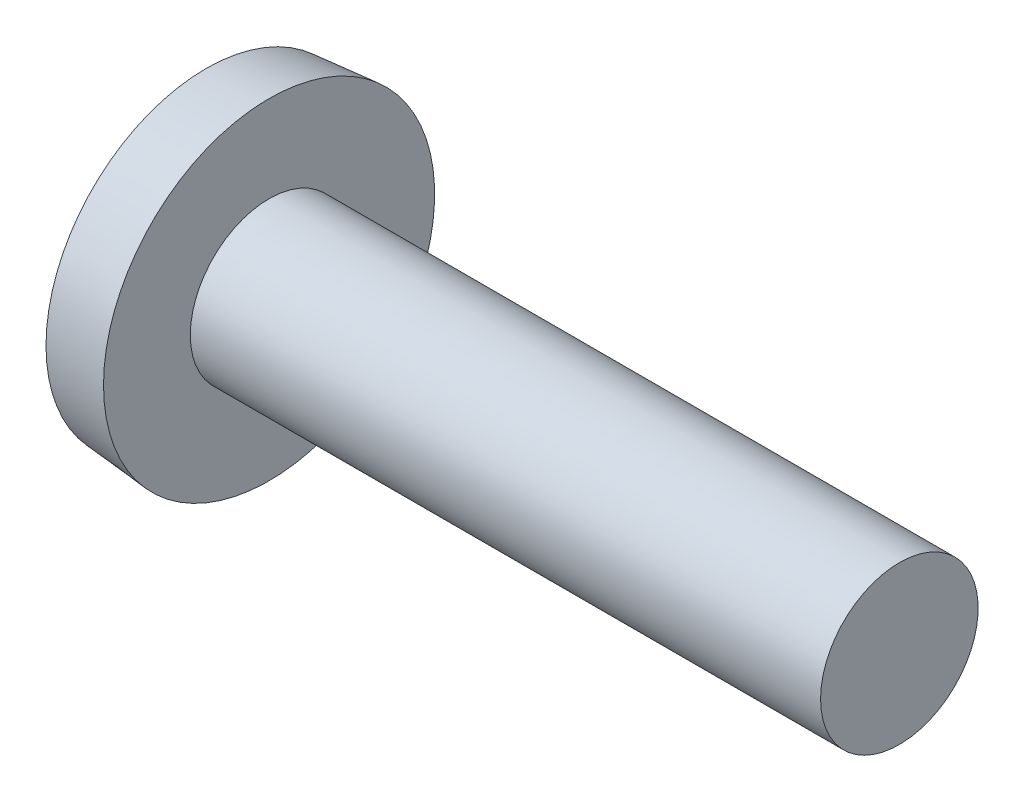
ISO-10303-21;
HEADER;
FILE_DESCRIPTION(('STEP AP214'),'2;1');
FILE_NAME('part.step','',(''),(''),'','','');
FILE_SCHEMA(('AUTOMOTIVE_DESIGN { 1 0 10303 214 1 1 1 1 }'));
ENDSEC;
DATA;
#1=APPLICATION_CONTEXT('core data for automotive mechanical design processes');
#2=APPLICATION_PROTOCOL_DEFINITION('international standard','automotive_design',2000,#1);
#3=PRODUCT_CONTEXT('',#1,'mechanical');
#4=PRODUCT('Part','Part','',(#3));
#5=PRODUCT_RELATED_PRODUCT_CATEGORY('part','',(#4));
#6=PRODUCT_DEFINITION_FORMATION('','',#4);
#7=PRODUCT_DEFINITION_CONTEXT('part definition',#1,'design');
#8=PRODUCT_DEFINITION('design','',#6,#7);
#9=PRODUCT_DEFINITION_SHAPE('','',#8);
#10=(LENGTH_UNIT() NAMED_UNIT(*) SI_UNIT(.MILLI.,.METRE.));
#11=(NAMED_UNIT(*) PLANE_ANGLE_UNIT() SI_UNIT($,.RADIAN.));
#12=(NAMED_UNIT(*) SI_UNIT($,.STERADIAN.) SOLID_ANGLE_UNIT());
#13=UNCERTAINTY_MEASURE_WITH_UNIT(LENGTH_MEASURE(1.E-05),#10,'distance_accuracy_value','');
#14=(GEOMETRIC_REPRESENTATION_CONTEXT(3) GLOBAL_UNCERTAINTY_ASSIGNED_CONTEXT((#13)) GLOBAL_UNIT_ASSIGNED_CONTEXT((#10,
#11,#12)) REPRESENTATION_CONTEXT('',''));
#15=CARTESIAN_POINT('',(0.,0.,0.));
#16=DIRECTION('',(0.,0.,1.));
#17=DIRECTION('',(1.,0.,0.));
#18=AXIS2_PLACEMENT_3D('',#15,#16,#17);
#19=CARTESIAN_POINT('',(20.7932858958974,0.,0.));
#20=DIRECTION('',(-1.,0.,0.));
#21=DIRECTION('',(0.,1.,0.));
#22=AXIS2_PLACEMENT_3D('',#19,#20,#21);
#23=SPHERICAL_SURFACE('',#22,20.7932858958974);
#24=CARTESIAN_POINT('',(10.7968001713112,0.,-7.77883530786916));
#25=DIRECTION('',(0.789207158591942,0.,0.61412707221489));
#26=DIRECTION('',(0.61412707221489,0.,-0.789207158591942));
#27=AXIS2_PLACEMENT_3D('',#24,#25,#26);
#28=CIRCLE('',#27,16.4900191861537);
#29=CARTESIAN_POINT('',(0.683324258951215,0.850899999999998,5.21786838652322));
#30=VERTEX_POINT('',#29);
#31=CARTESIAN_POINT('',(0.686560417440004,0.94739679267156,5.21370963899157));
#32=VERTEX_POINT('',#31);
#33=EDGE_CURVE('E386',#30,#32,#28,.F.);
#34=ORIENTED_EDGE('',*,*,#33,.F.);
#35=CARTESIAN_POINT('',(20.7932858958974,0.850899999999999,0.));
#36=DIRECTION('',(0.,-1.,0.));
#37=DIRECTION('',(0.,0.,-1.));
#38=AXIS2_PLACEMENT_3D('',#35,#36,#37);
#39=CIRCLE('',#38,20.7758683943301);
#40=CARTESIAN_POINT('',(2.2606,0.850899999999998,9.39022156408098));
#41=VERTEX_POINT('',#40);
#42=EDGE_CURVE('E278',#30,#41,#39,.F.);
#43=ORIENTED_EDGE('',*,*,#42,.T.);
#44=CARTESIAN_POINT('',(2.2606,0.,0.));
#45=DIRECTION('',(-1.,0.,0.));
#46=DIRECTION('',(0.,0.,1.));
#47=AXIS2_PLACEMENT_3D('',#44,#45,#46);
#48=CIRCLE('',#47,9.42869512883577);
#49=CARTESIAN_POINT('',(2.2606,-0.8509,9.39022156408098));
#50=VERTEX_POINT('',#49);
#51=EDGE_CURVE('E280',#41,#50,#48,.F.);
#52=ORIENTED_EDGE('',*,*,#51,.T.);
#53=CARTESIAN_POINT('',(20.7932858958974,-0.8509,0.));
#54=DIRECTION('',(0.,1.,0.));
#55=DIRECTION('',(0.,0.,1.));
#56=AXIS2_PLACEMENT_3D('',#53,#54,#55);
#57=CIRCLE('',#56,20.7758683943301);
#58=CARTESIAN_POINT('',(0.683324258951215,-0.8509,5.21786838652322));
#59=VERTEX_POINT('',#58);
#60=EDGE_CURVE('E286',#50,#59,#57,.F.);
#61=ORIENTED_EDGE('',*,*,#60,.T.);
#62=CARTESIAN_POINT('',(0.68656041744,-0.947396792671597,5.21370963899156));
#63=VERTEX_POINT('',#62);
#64=EDGE_CURVE('E387',#63,#59,#28,.F.);
#65=ORIENTED_EDGE('',*,*,#64,.F.);
#66=CARTESIAN_POINT('',(20.6258579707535,1.41383581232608,0.));
#67=DIRECTION('',(-0.117599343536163,0.993061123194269,0.));
#68=DIRECTION('',(-0.993061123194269,-0.117599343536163,0.));
#69=AXIS2_PLACEMENT_3D('',#66,#67,#68);
#70=CIRCLE('',#69,20.7444878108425);
#71=CARTESIAN_POINT('',(0.0503651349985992,-1.02273570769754,1.02273570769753));
#72=VERTEX_POINT('',#71);
#73=EDGE_CURVE('E373',#63,#72,#70,.F.);
#74=ORIENTED_EDGE('',*,*,#73,.T.);
#75=CARTESIAN_POINT('',(20.6258579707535,0.,-1.41383581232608));
#76=DIRECTION('',(-0.117599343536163,0.,-0.993061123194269));
#77=DIRECTION('',(-0.993061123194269,0.,0.117599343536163));
#78=AXIS2_PLACEMENT_3D('',#75,#76,#77);
#79=CIRCLE('',#78,20.7444878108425);
#80=CARTESIAN_POINT('',(0.686560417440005,-5.21370963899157,0.947396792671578));
#81=VERTEX_POINT('',#80);
#82=EDGE_CURVE('E247',#72,#81,#79,.F.);
#83=ORIENTED_EDGE('',*,*,#82,.T.);
#84=CARTESIAN_POINT('',(10.7968001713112,7.77883530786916,0.));
#85=DIRECTION('',(0.789207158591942,-0.61412707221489,0.));
#86=DIRECTION('',(0.61412707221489,0.789207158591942,0.));
#87=AXIS2_PLACEMENT_3D('',#84,#85,#86);
#88=CIRCLE('',#87,16.4900191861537);
#89=CARTESIAN_POINT('',(0.686560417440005,-5.21370963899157,-0.947396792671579));
#90=VERTEX_POINT('',#89);
#91=EDGE_CURVE('E298',#90,#81,#88,.F.);
#92=ORIENTED_EDGE('',*,*,#91,.F.);
#93=CARTESIAN_POINT('',(20.6258579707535,0.,1.41383581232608));
#94=DIRECTION('',(-0.117599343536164,0.,0.993061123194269));
#95=DIRECTION('',(0.993061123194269,0.,0.117599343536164));
#96=AXIS2_PLACEMENT_3D('',#93,#94,#95);
#97=CIRCLE('',#96,20.7444878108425);
#98=CARTESIAN_POINT('',(0.0503651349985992,-1.02273570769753,-1.02273570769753));
#99=VERTEX_POINT('',#98);
#100=EDGE_CURVE('E259',#90,#99,#97,.F.);
#101=ORIENTED_EDGE('',*,*,#100,.T.);
#102=CARTESIAN_POINT('',(0.686560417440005,-0.94739679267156,-5.21370963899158));
#103=VERTEX_POINT('',#102);
#104=EDGE_CURVE('E52',#99,#103,#70,.F.);
#105=ORIENTED_EDGE('',*,*,#104,.T.);
#106=CARTESIAN_POINT('',(10.7968001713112,0.,7.77883530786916));
#107=DIRECTION('',(0.789207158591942,0.,-0.61412707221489));
#108=DIRECTION('',(-0.61412707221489,0.,-0.789207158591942));
#109=AXIS2_PLACEMENT_3D('',#106,#107,#108);
#110=CIRCLE('',#109,16.4900191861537);
#111=CARTESIAN_POINT('',(0.683324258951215,-0.8509,-5.21786838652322));
#112=VERTEX_POINT('',#111);
#113=EDGE_CURVE('E361',#112,#103,#110,.F.);
#114=ORIENTED_EDGE('',*,*,#113,.F.);
#115=CARTESIAN_POINT('',(2.2606,-0.8509,-9.39022156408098));
#116=VERTEX_POINT('',#115);
#117=EDGE_CURVE('E284',#112,#116,#57,.F.);
#118=ORIENTED_EDGE('',*,*,#117,.T.);
#119=CARTESIAN_POINT('',(2.2606,0.8509,-9.39022156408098));
#120=VERTEX_POINT('',#119);
#121=EDGE_CURVE('E283',#116,#120,#48,.F.);
#122=ORIENTED_EDGE('',*,*,#121,.T.);
#123=CARTESIAN_POINT('',(0.683324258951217,0.850899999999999,-5.21786838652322));
#124=VERTEX_POINT('',#123);
#125=EDGE_CURVE('E285',#120,#124,#39,.F.);
#126=ORIENTED_EDGE('',*,*,#125,.T.);
#127=CARTESIAN_POINT('',(0.686560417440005,0.947396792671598,-5.21370963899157));
#128=VERTEX_POINT('',#127);
#129=EDGE_CURVE('E367',#128,#124,#110,.F.);
#130=ORIENTED_EDGE('',*,*,#129,.F.);
#131=CARTESIAN_POINT('',(20.6258579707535,-1.41383581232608,0.));
#132=DIRECTION('',(-0.117599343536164,-0.993061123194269,0.));
#133=DIRECTION('',(0.993061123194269,-0.117599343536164,0.));
#134=AXIS2_PLACEMENT_3D('',#131,#132,#133);
#135=CIRCLE('',#134,20.7444878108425);
#136=CARTESIAN_POINT('',(0.0503651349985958,1.02273570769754,-1.02273570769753));
#137=VERTEX_POINT('',#136);
#138=EDGE_CURVE('E234',#128,#137,#135,.F.);
#139=ORIENTED_EDGE('',*,*,#138,.T.);
#140=CARTESIAN_POINT('',(0.68656041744,5.21370963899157,-0.947396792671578));
#141=VERTEX_POINT('',#140);
#142=EDGE_CURVE('E251',#137,#141,#97,.F.);
#143=ORIENTED_EDGE('',*,*,#142,.T.);
#144=CARTESIAN_POINT('',(10.7968001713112,-7.77883530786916,0.));
#145=DIRECTION('',(0.789207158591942,0.61412707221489,0.));
#146=DIRECTION('',(-0.61412707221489,0.789207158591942,0.));
#147=AXIS2_PLACEMENT_3D('',#144,#145,#146);
#148=CIRCLE('',#147,16.4900191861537);
#149=CARTESIAN_POINT('',(0.686560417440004,5.21370963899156,0.947396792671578));
#150=VERTEX_POINT('',#149);
#151=EDGE_CURVE('E296',#150,#141,#148,.F.);
#152=ORIENTED_EDGE('',*,*,#151,.F.);
#153=CARTESIAN_POINT('',(0.0503651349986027,1.02273570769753,1.02273570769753));
#154=VERTEX_POINT('',#153);
#155=EDGE_CURVE('E211',#150,#154,#79,.F.);
#156=ORIENTED_EDGE('',*,*,#155,.T.);
#157=EDGE_CURVE('E238',#154,#32,#135,.F.);
#158=ORIENTED_EDGE('',*,*,#157,.T.);
#159=EDGE_LOOP('',(#34,#43,#52,#61,#65,#74,#83,#92,#101,#105,#114,#118,#122,#126,#130,#139,#143,
#152,#156,#158));
#160=FACE_BOUND('',#159,.T.);
#161=CARTESIAN_POINT('',(2.3876,0.,0.));
#162=DIRECTION('',(-1.,0.,0.));
#163=DIRECTION('',(0.,0.,1.));
#164=AXIS2_PLACEMENT_3D('',#161,#162,#163);
#165=CIRCLE('',#164,9.67426819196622);
#166=CARTESIAN_POINT('',(2.3876,0.,9.67426819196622));
#167=VERTEX_POINT('',#166);
#168=EDGE_CURVE('E272',#167,#167,#165,.T.);
#169=ORIENTED_EDGE('',*,*,#168,.T.);
#170=EDGE_LOOP('',(#169));
#171=FACE_BOUND('',#170,.T.);
#172=ADVANCED_FACE('F36',(#160,#171),#23,.T.);
#173=CARTESIAN_POINT('',(2.2606,-0.8509,10.0076));
#174=DIRECTION('',(0.,1.,0.));
#175=DIRECTION('',(0.,0.,1.));
#176=AXIS2_PLACEMENT_3D('',#173,#174,#175);
#177=PLANE('',#176);
#178=DIRECTION('',(-0.61412707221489,0.,-0.789207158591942));
#179=VECTOR('',#178,1.);
#180=CARTESIAN_POINT('',(8.65757782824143,-0.8509,5.02974694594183));
#181=LINE('',#180,#179);
#182=CARTESIAN_POINT('',(1.50142222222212,-0.850899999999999,-4.16654074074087));
#183=VERTEX_POINT('',#182);
#184=EDGE_CURVE('E370',#183,#112,#181,.T.);
#185=ORIENTED_EDGE('',*,*,#184,.F.);
#186=DIRECTION('',(0.,0.,1.));
#187=VECTOR('',#186,1.);
#188=CARTESIAN_POINT('',(1.50142222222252,-0.8509,10.0076));
#189=LINE('',#188,#187);
#190=CARTESIAN_POINT('',(1.50142222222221,-0.850899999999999,-0.850900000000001));
#191=VERTEX_POINT('',#190);
#192=EDGE_CURVE('E379',#183,#191,#189,.T.);
#193=ORIENTED_EDGE('',*,*,#192,.T.);
#194=DIRECTION('',(0.993061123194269,0.,0.117599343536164));
#195=VECTOR('',#194,1.);
#196=CARTESIAN_POINT('',(3.51819272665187,-0.8509,-0.61207191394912));
#197=LINE('',#196,#195);
#198=CARTESIAN_POINT('',(2.2606,-0.8509,-0.760997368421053));
#199=VERTEX_POINT('',#198);
#200=EDGE_CURVE('E255',#191,#199,#197,.T.);
#201=ORIENTED_EDGE('',*,*,#200,.T.);
#202=DIRECTION('',(0.,0.,-1.));
#203=VECTOR('',#202,1.);
#204=CARTESIAN_POINT('',(2.2606,-0.8509,10.0076));
#205=LINE('',#204,#203);
#206=EDGE_CURVE('E262',#199,#116,#205,.T.);
#207=ORIENTED_EDGE('',*,*,#206,.T.);
#208=ORIENTED_EDGE('',*,*,#117,.F.);
#209=EDGE_LOOP('',(#185,#193,#201,#207,#208));
#210=FACE_BOUND('',#209,.T.);
#211=ADVANCED_FACE('F438',(#210),#177,.T.);
#212=CARTESIAN_POINT('',(2.2606,0.8509,-10.0076));
#213=DIRECTION('',(0.,-1.,0.));
#214=DIRECTION('',(0.,0.,-1.));
#215=AXIS2_PLACEMENT_3D('',#212,#213,#214);
#216=PLANE('',#215);
#217=DIRECTION('',(-0.993061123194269,0.,-0.117599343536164));
#218=VECTOR('',#217,1.);
#219=CARTESIAN_POINT('',(1.18075089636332,0.850899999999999,-0.888874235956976));
#220=LINE('',#219,#218);
#221=CARTESIAN_POINT('',(2.2606,0.8509,-0.760997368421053));
#222=VERTEX_POINT('',#221);
#223=CARTESIAN_POINT('',(1.50142222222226,0.850899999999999,-0.850899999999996));
#224=VERTEX_POINT('',#223);
#225=EDGE_CURVE('E248',#222,#224,#220,.T.);
#226=ORIENTED_EDGE('',*,*,#225,.T.);
#227=DIRECTION('',(0.,0.,-1.));
#228=VECTOR('',#227,1.);
#229=CARTESIAN_POINT('',(1.50142222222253,0.8509,-10.0076));
#230=LINE('',#229,#228);
#231=CARTESIAN_POINT('',(1.50142222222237,0.850899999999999,-4.16654074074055));
#232=VERTEX_POINT('',#231);
#233=EDGE_CURVE('E64',#224,#232,#230,.T.);
#234=ORIENTED_EDGE('',*,*,#233,.T.);
#235=DIRECTION('',(0.61412707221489,0.,0.789207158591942));
#236=VECTOR('',#235,1.);
#237=CARTESIAN_POINT('',(-1.04325884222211,0.8509,-7.43667912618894));
#238=LINE('',#237,#236);
#239=EDGE_CURVE('E402',#124,#232,#238,.T.);
#240=ORIENTED_EDGE('',*,*,#239,.F.);
#241=ORIENTED_EDGE('',*,*,#125,.F.);
#242=DIRECTION('',(0.,0.,1.));
#243=VECTOR('',#242,1.);
#244=CARTESIAN_POINT('',(2.2606,0.8509,-10.0076));
#245=LINE('',#244,#243);
#246=EDGE_CURVE('E265',#120,#222,#245,.T.);
#247=ORIENTED_EDGE('',*,*,#246,.T.);
#248=EDGE_LOOP('',(#226,#234,#240,#241,#247));
#249=FACE_BOUND('',#248,.T.);
#250=ADVANCED_FACE('F397',(#249),#216,.T.);
#251=CARTESIAN_POINT('',(2.2606,-0.8509,10.0076));
#252=DIRECTION('',(-1.,0.,0.));
#253=DIRECTION('',(0.,0.,1.));
#254=AXIS2_PLACEMENT_3D('',#251,#252,#253);
#255=PLANE('',#254);
#256=DIRECTION('',(0.,-1.,0.));
#257=VECTOR('',#256,1.);
#258=CARTESIAN_POINT('',(2.2606,-0.850899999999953,-3.19093070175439));
#259=LINE('',#258,#257);
#260=CARTESIAN_POINT('',(2.2606,0.760997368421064,-3.19093070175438));
#261=VERTEX_POINT('',#260);
#262=CARTESIAN_POINT('',(2.2606,-0.760997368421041,-3.19093070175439));
#263=VERTEX_POINT('',#262);
#264=EDGE_CURVE('E331',#261,#263,#259,.T.);
#265=ORIENTED_EDGE('',*,*,#264,.F.);
#266=DIRECTION('',(0.,0.,1.));
#267=VECTOR('',#266,1.);
#268=CARTESIAN_POINT('',(2.2606,0.760997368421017,10.0076));
#269=LINE('',#268,#267);
#270=CARTESIAN_POINT('',(2.2606,0.760997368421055,-0.760997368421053));
#271=VERTEX_POINT('',#270);
#272=EDGE_CURVE('E393',#261,#271,#269,.T.);
#273=ORIENTED_EDGE('',*,*,#272,.T.);
#274=DIRECTION('',(0.,1.,0.));
#275=VECTOR('',#274,1.);
#276=CARTESIAN_POINT('',(2.2606,-0.850899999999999,-0.760997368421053));
#277=LINE('',#276,#275);
#278=EDGE_CURVE('E293',#271,#222,#277,.T.);
#279=ORIENTED_EDGE('',*,*,#278,.T.);
#280=ORIENTED_EDGE('',*,*,#246,.F.);
#281=ORIENTED_EDGE('',*,*,#121,.F.);
#282=ORIENTED_EDGE('',*,*,#206,.F.);
#283=CARTESIAN_POINT('',(2.2606,-0.76099736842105,-0.760997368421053));
#284=VERTEX_POINT('',#283);
#285=EDGE_CURVE('E291',#199,#284,#277,.T.);
#286=ORIENTED_EDGE('',*,*,#285,.T.);
#287=DIRECTION('',(0.,0.,-1.));
#288=VECTOR('',#287,1.);
#289=CARTESIAN_POINT('',(2.2606,-0.760997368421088,10.0076));
#290=LINE('',#289,#288);
#291=EDGE_CURVE('E338',#284,#263,#290,.T.);
#292=ORIENTED_EDGE('',*,*,#291,.T.);
#293=EDGE_LOOP('',(#265,#273,#279,#280,#281,#282,#286,#292));
#294=FACE_BOUND('',#293,.T.);
#295=ADVANCED_FACE('F401',(#294),#255,.T.);
#296=DIRECTION('',(0.,-1.,0.));
#297=VECTOR('',#296,1.);
#298=CARTESIAN_POINT('',(2.2606,-0.8509,0.760997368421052));
#299=LINE('',#298,#297);
#300=CARTESIAN_POINT('',(2.2606,0.8509,0.760997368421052));
#301=VERTEX_POINT('',#300);
#302=CARTESIAN_POINT('',(2.2606,0.76099736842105,0.760997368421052));
#303=VERTEX_POINT('',#302);
#304=EDGE_CURVE('E288',#301,#303,#299,.T.);
#305=ORIENTED_EDGE('',*,*,#304,.T.);
#306=DIRECTION('',(0.,0.,1.));
#307=VECTOR('',#306,1.);
#308=CARTESIAN_POINT('',(2.2606,0.760997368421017,10.0076));
#309=LINE('',#308,#307);
#310=CARTESIAN_POINT('',(2.2606,0.760997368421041,3.19093070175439));
#311=VERTEX_POINT('',#310);
#312=EDGE_CURVE('E191',#303,#311,#309,.T.);
#313=ORIENTED_EDGE('',*,*,#312,.T.);
#314=DIRECTION('',(0.,1.,0.));
#315=VECTOR('',#314,1.);
#316=CARTESIAN_POINT('',(2.2606,-0.850899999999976,3.19093070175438));
#317=LINE('',#316,#315);
#318=CARTESIAN_POINT('',(2.2606,-0.760997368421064,3.19093070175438));
#319=VERTEX_POINT('',#318);
#320=EDGE_CURVE('E203',#319,#311,#317,.T.);
#321=ORIENTED_EDGE('',*,*,#320,.F.);
#322=DIRECTION('',(0.,0.,-1.));
#323=VECTOR('',#322,1.);
#324=CARTESIAN_POINT('',(2.2606,-0.760997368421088,10.0076));
#325=LINE('',#324,#323);
#326=CARTESIAN_POINT('',(2.2606,-0.760997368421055,0.760997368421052));
#327=VERTEX_POINT('',#326);
#328=EDGE_CURVE('E365',#319,#327,#325,.T.);
#329=ORIENTED_EDGE('',*,*,#328,.T.);
#330=CARTESIAN_POINT('',(2.2606,-0.8509,0.760997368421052));
#331=VERTEX_POINT('',#330);
#332=EDGE_CURVE('E292',#327,#331,#299,.T.);
#333=ORIENTED_EDGE('',*,*,#332,.T.);
#334=EDGE_CURVE('E256',#50,#331,#205,.T.);
#335=ORIENTED_EDGE('',*,*,#334,.F.);
#336=ORIENTED_EDGE('',*,*,#51,.F.);
#337=EDGE_CURVE('E257',#301,#41,#245,.T.);
#338=ORIENTED_EDGE('',*,*,#337,.F.);
#339=EDGE_LOOP('',(#305,#313,#321,#329,#333,#335,#336,#338));
#340=FACE_BOUND('',#339,.T.);
#341=ADVANCED_FACE('F413',(#340),#255,.T.);
#342=CARTESIAN_POINT('',(4.74364505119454,0.,-0.466952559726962));
#343=DIRECTION('',(-0.117599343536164,0.,0.993061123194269));
#344=DIRECTION('',(0.993061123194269,0.,0.117599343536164));
#345=AXIS2_PLACEMENT_3D('',#342,#343,#344);
#346=PLANE('',#345);
#347=ORIENTED_EDGE('',*,*,#142,.F.);
#348=DIRECTION('',(0.986264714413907,-0.116794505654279,0.116794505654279));
#349=VECTOR('',#348,1.);
#350=CARTESIAN_POINT('',(4.79743345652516,0.460582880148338,-0.460582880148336));
#351=LINE('',#350,#349);
#352=EDGE_CURVE('E311',#137,#224,#351,.T.);
#353=ORIENTED_EDGE('',*,*,#352,.T.);
#354=ORIENTED_EDGE('',*,*,#225,.F.);
#355=ORIENTED_EDGE('',*,*,#278,.F.);
#356=CARTESIAN_POINT('',(4.3434,0.514350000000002,-0.514349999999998));
#357=VERTEX_POINT('',#356);
#358=EDGE_CURVE('E313',#271,#357,#351,.T.);
#359=ORIENTED_EDGE('',*,*,#358,.T.);
#360=DIRECTION('',(0.612509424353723,-0.787128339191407,0.0725340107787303));
#361=VECTOR('',#360,1.);
#362=CARTESIAN_POINT('',(0.,6.096,-1.0287));
#363=LINE('',#362,#361);
#364=EDGE_CURVE('E216',#141,#357,#363,.T.);
#365=ORIENTED_EDGE('',*,*,#364,.F.);
#366=EDGE_LOOP('',(#347,#353,#354,#355,#359,#365));
#367=FACE_BOUND('',#366,.T.);
#368=ADVANCED_FACE('F307',(#367),#346,.T.);
#369=DIRECTION('',(0.612509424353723,0.787128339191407,0.0725340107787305));
#370=VECTOR('',#369,1.);
#371=CARTESIAN_POINT('',(0.,-6.096,-1.0287));
#372=LINE('',#371,#370);
#373=CARTESIAN_POINT('',(4.3434,-0.51435,-0.51435));
#374=VERTEX_POINT('',#373);
#375=EDGE_CURVE('E217',#90,#374,#372,.T.);
#376=ORIENTED_EDGE('',*,*,#375,.T.);
#377=DIRECTION('',(-0.986264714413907,-0.116794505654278,-0.116794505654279));
#378=VECTOR('',#377,1.);
#379=CARTESIAN_POINT('',(4.79743345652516,-0.460582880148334,-0.460582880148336));
#380=LINE('',#379,#378);
#381=EDGE_CURVE('E336',#374,#284,#380,.T.);
#382=ORIENTED_EDGE('',*,*,#381,.T.);
#383=ORIENTED_EDGE('',*,*,#285,.F.);
#384=ORIENTED_EDGE('',*,*,#200,.F.);
#385=EDGE_CURVE('E341',#191,#99,#380,.T.);
#386=ORIENTED_EDGE('',*,*,#385,.T.);
#387=ORIENTED_EDGE('',*,*,#100,.F.);
#388=EDGE_LOOP('',(#376,#382,#383,#384,#386,#387));
#389=FACE_BOUND('',#388,.T.);
#390=ADVANCED_FACE('F348',(#389),#346,.T.);
#391=CARTESIAN_POINT('',(4.74364505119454,0.,0.466952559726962));
#392=DIRECTION('',(-0.117599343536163,0.,-0.993061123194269));
#393=DIRECTION('',(-0.993061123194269,0.,0.117599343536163));
#394=AXIS2_PLACEMENT_3D('',#391,#392,#393);
#395=PLANE('',#394);
#396=DIRECTION('',(0.612509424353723,-0.787128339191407,-0.0725340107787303));
#397=VECTOR('',#396,1.);
#398=CARTESIAN_POINT('',(0.,6.096,1.0287));
#399=LINE('',#398,#397);
#400=CARTESIAN_POINT('',(4.3434,0.514349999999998,0.514350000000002));
#401=VERTEX_POINT('',#400);
#402=EDGE_CURVE('E209',#150,#401,#399,.T.);
#403=ORIENTED_EDGE('',*,*,#402,.T.);
#404=DIRECTION('',(-0.986264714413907,0.116794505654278,0.116794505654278));
#405=VECTOR('',#404,1.);
#406=CARTESIAN_POINT('',(4.79743345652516,0.460582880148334,0.460582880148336));
#407=LINE('',#406,#405);
#408=EDGE_CURVE('E11',#401,#303,#407,.T.);
#409=ORIENTED_EDGE('',*,*,#408,.T.);
#410=ORIENTED_EDGE('',*,*,#304,.F.);
#411=DIRECTION('',(0.993061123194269,0.,-0.117599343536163));
#412=VECTOR('',#411,1.);
#413=CARTESIAN_POINT('',(3.51819272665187,0.850899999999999,0.612071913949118));
#414=LINE('',#413,#412);
#415=CARTESIAN_POINT('',(1.50142222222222,0.850899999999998,0.850899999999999));
#416=VERTEX_POINT('',#415);
#417=EDGE_CURVE('E245',#416,#301,#414,.T.);
#418=ORIENTED_EDGE('',*,*,#417,.F.);
#419=EDGE_CURVE('E45',#416,#154,#407,.T.);
#420=ORIENTED_EDGE('',*,*,#419,.T.);
#421=ORIENTED_EDGE('',*,*,#155,.F.);
#422=EDGE_LOOP('',(#403,#409,#410,#418,#420,#421));
#423=FACE_BOUND('',#422,.T.);
#424=ADVANCED_FACE('F212',(#423),#395,.T.);
#425=ORIENTED_EDGE('',*,*,#82,.F.);
#426=DIRECTION('',(0.986264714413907,0.116794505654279,-0.116794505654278));
#427=VECTOR('',#426,1.);
#428=CARTESIAN_POINT('',(4.79743345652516,-0.460582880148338,0.460582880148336));
#429=LINE('',#428,#427);
#430=CARTESIAN_POINT('',(1.5014222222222,-0.850900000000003,0.850900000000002));
#431=VERTEX_POINT('',#430);
#432=EDGE_CURVE('E362',#72,#431,#429,.T.);
#433=ORIENTED_EDGE('',*,*,#432,.T.);
#434=DIRECTION('',(-0.993061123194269,0.,0.117599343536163));
#435=VECTOR('',#434,1.);
#436=CARTESIAN_POINT('',(1.18075089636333,-0.8509,0.888874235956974));
#437=LINE('',#436,#435);
#438=EDGE_CURVE('E242',#331,#431,#437,.T.);
#439=ORIENTED_EDGE('',*,*,#438,.F.);
#440=ORIENTED_EDGE('',*,*,#332,.F.);
#441=CARTESIAN_POINT('',(4.3434,-0.51435,0.51435));
#442=VERTEX_POINT('',#441);
#443=EDGE_CURVE('E356',#327,#442,#429,.T.);
#444=ORIENTED_EDGE('',*,*,#443,.T.);
#445=DIRECTION('',(0.612509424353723,0.787128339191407,-0.0725340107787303));
#446=VECTOR('',#445,1.);
#447=CARTESIAN_POINT('',(0.,-6.096,1.0287));
#448=LINE('',#447,#446);
#449=EDGE_CURVE('E324',#81,#442,#448,.T.);
#450=ORIENTED_EDGE('',*,*,#449,.F.);
#451=EDGE_LOOP('',(#425,#433,#439,#440,#444,#450));
#452=FACE_BOUND('',#451,.T.);
#453=ADVANCED_FACE('F354',(#452),#395,.T.);
#454=DIRECTION('',(0.61412707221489,0.,-0.789207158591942));
#455=VECTOR('',#454,1.);
#456=CARTESIAN_POINT('',(-1.04325884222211,-0.8509,7.43667912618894));
#457=LINE('',#456,#455);
#458=CARTESIAN_POINT('',(1.50142222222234,-0.8509,4.16654074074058));
#459=VERTEX_POINT('',#458);
#460=EDGE_CURVE('E388',#59,#459,#457,.T.);
#461=ORIENTED_EDGE('',*,*,#460,.F.);
#462=ORIENTED_EDGE('',*,*,#60,.F.);
#463=ORIENTED_EDGE('',*,*,#334,.T.);
#464=ORIENTED_EDGE('',*,*,#438,.T.);
#465=DIRECTION('',(0.,0.,1.));
#466=VECTOR('',#465,1.);
#467=CARTESIAN_POINT('',(1.50142222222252,-0.8509,10.0076));
#468=LINE('',#467,#466);
#469=EDGE_CURVE('E371',#431,#459,#468,.T.);
#470=ORIENTED_EDGE('',*,*,#469,.T.);
#471=EDGE_LOOP('',(#461,#462,#463,#464,#470));
#472=FACE_BOUND('',#471,.T.);
#473=ADVANCED_FACE('F412',(#472),#177,.T.);
#474=DIRECTION('',(-0.61412707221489,0.,0.789207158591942));
#475=VECTOR('',#474,1.);
#476=CARTESIAN_POINT('',(8.65757782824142,0.850899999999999,-5.02974694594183));
#477=LINE('',#476,#475);
#478=CARTESIAN_POINT('',(1.50142222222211,0.850899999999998,4.16654074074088));
#479=VERTEX_POINT('',#478);
#480=EDGE_CURVE('E383',#479,#30,#477,.T.);
#481=ORIENTED_EDGE('',*,*,#480,.F.);
#482=DIRECTION('',(0.,0.,-1.));
#483=VECTOR('',#482,1.);
#484=CARTESIAN_POINT('',(1.50142222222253,0.8509,-10.0076));
#485=LINE('',#484,#483);
#486=EDGE_CURVE('E395',#479,#416,#485,.T.);
#487=ORIENTED_EDGE('',*,*,#486,.T.);
#488=ORIENTED_EDGE('',*,*,#417,.T.);
#489=ORIENTED_EDGE('',*,*,#337,.T.);
#490=ORIENTED_EDGE('',*,*,#42,.F.);
#491=EDGE_LOOP('',(#481,#487,#488,#489,#490));
#492=FACE_BOUND('',#491,.T.);
#493=ADVANCED_FACE('F423',(#492),#216,.T.);
#494=CARTESIAN_POINT('',(-25.4,0.,0.));
#495=DIRECTION('',(-1.,0.,0.));
#496=DIRECTION('',(0.,0.,1.));
#497=AXIS2_PLACEMENT_3D('',#494,#495,#496);
#498=CYLINDRICAL_SURFACE('',#497,4.7625);
#499=CARTESIAN_POINT('',(44.2976,0.,0.));
#500=DIRECTION('',(-1.,0.,0.));
#501=DIRECTION('',(0.,0.,1.));
#502=AXIS2_PLACEMENT_3D('',#499,#500,#501);
#503=CIRCLE('',#502,4.7625);
#504=CARTESIAN_POINT('',(44.2976,0.,4.7625));
#505=VERTEX_POINT('',#504);
#506=EDGE_CURVE('E274',#505,#505,#503,.T.);
#507=ORIENTED_EDGE('',*,*,#506,.T.);
#508=EDGE_LOOP('',(#507));
#509=FACE_BOUND('',#508,.T.);
#510=CARTESIAN_POINT('',(6.1976,0.,0.));
#511=DIRECTION('',(-1.,0.,0.));
#512=DIRECTION('',(0.,0.,1.));
#513=AXIS2_PLACEMENT_3D('',#510,#511,#512);
#514=CIRCLE('',#513,4.7625);
#515=CARTESIAN_POINT('',(6.1976,0.,4.7625));
#516=VERTEX_POINT('',#515);
#517=EDGE_CURVE('E263',#516,#516,#514,.T.);
#518=ORIENTED_EDGE('',*,*,#517,.F.);
#519=EDGE_LOOP('',(#518));
#520=FACE_BOUND('',#519,.T.);
#521=ADVANCED_FACE('F37',(#509,#520),#498,.T.);
#522=CARTESIAN_POINT('',(44.2976,4.7625,0.));
#523=DIRECTION('',(1.,0.,0.));
#524=DIRECTION('',(0.,0.,-1.));
#525=AXIS2_PLACEMENT_3D('',#522,#523,#524);
#526=PLANE('',#525);
#527=ORIENTED_EDGE('',*,*,#506,.F.);
#528=EDGE_LOOP('',(#527));
#529=FACE_BOUND('',#528,.T.);
#530=ADVANCED_FACE('F469',(#529),#526,.T.);
#531=CARTESIAN_POINT('',(6.1976,0.,0.));
#532=DIRECTION('',(1.,0.,0.));
#533=DIRECTION('',(0.,0.,-1.));
#534=AXIS2_PLACEMENT_3D('',#531,#532,#533);
#535=CONICAL_SURFACE('',#534,10.0076,0.0872664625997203);
#536=ORIENTED_EDGE('',*,*,#168,.F.);
#537=EDGE_LOOP('',(#536));
#538=FACE_BOUND('',#537,.T.);
#539=CARTESIAN_POINT('',(6.1976,0.,0.));
#540=DIRECTION('',(-1.,0.,0.));
#541=DIRECTION('',(0.,0.,1.));
#542=AXIS2_PLACEMENT_3D('',#539,#540,#541);
#543=CIRCLE('',#542,10.0076);
#544=CARTESIAN_POINT('',(6.1976,0.,10.0076));
#545=VERTEX_POINT('',#544);
#546=EDGE_CURVE('E270',#545,#545,#543,.T.);
#547=ORIENTED_EDGE('',*,*,#546,.T.);
#548=EDGE_LOOP('',(#547));
#549=FACE_BOUND('',#548,.T.);
#550=ADVANCED_FACE('F470',(#538,#549),#535,.T.);
#551=CARTESIAN_POINT('',(6.1976,4.7625,0.));
#552=DIRECTION('',(-1.,0.,0.));
#553=DIRECTION('',(0.,0.,1.));
#554=AXIS2_PLACEMENT_3D('',#551,#552,#553);
#555=PLANE('',#554);
#556=ORIENTED_EDGE('',*,*,#546,.F.);
#557=EDGE_LOOP('',(#556));
#558=FACE_BOUND('',#557,.T.);
#559=ORIENTED_EDGE('',*,*,#517,.T.);
#560=EDGE_LOOP('',(#559));
#561=FACE_BOUND('',#560,.T.);
#562=ADVANCED_FACE('F478',(#558,#561),#555,.F.);
#563=CARTESIAN_POINT('',(4.3434,0.51435,0.51435));
#564=DIRECTION('',(-1.,0.,0.));
#565=DIRECTION('',(0.,0.,1.));
#566=AXIS2_PLACEMENT_3D('',#563,#564,#565);
#567=PLANE('',#566);
#568=DIRECTION('',(0.,1.,0.));
#569=VECTOR('',#568,1.);
#570=CARTESIAN_POINT('',(4.3434,-0.51435,0.51435));
#571=LINE('',#570,#569);
#572=EDGE_CURVE('E204',#442,#401,#571,.T.);
#573=ORIENTED_EDGE('',*,*,#572,.T.);
#574=DIRECTION('',(0.,0.,-1.));
#575=VECTOR('',#574,1.);
#576=CARTESIAN_POINT('',(4.3434,0.51435,0.51435));
#577=LINE('',#576,#575);
#578=EDGE_CURVE('E222',#401,#357,#577,.T.);
#579=ORIENTED_EDGE('',*,*,#578,.T.);
#580=DIRECTION('',(0.,-1.,0.));
#581=VECTOR('',#580,1.);
#582=CARTESIAN_POINT('',(4.3434,0.51435,-0.51435));
#583=LINE('',#582,#581);
#584=EDGE_CURVE('E226',#357,#374,#583,.T.);
#585=ORIENTED_EDGE('',*,*,#584,.T.);
#586=DIRECTION('',(0.,0.,1.));
#587=VECTOR('',#586,1.);
#588=CARTESIAN_POINT('',(4.3434,-0.51435,-0.51435));
#589=LINE('',#588,#587);
#590=EDGE_CURVE('E231',#374,#442,#589,.T.);
#591=ORIENTED_EDGE('',*,*,#590,.T.);
#592=EDGE_LOOP('',(#573,#579,#585,#591));
#593=FACE_BOUND('',#592,.T.);
#594=ADVANCED_FACE('F233',(#593),#567,.T.);
#595=CARTESIAN_POINT('',(4.3434,0.51435,0.51435));
#596=DIRECTION('',(0.789207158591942,0.61412707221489,0.));
#597=DIRECTION('',(-0.61412707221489,0.789207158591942,0.));
#598=AXIS2_PLACEMENT_3D('',#595,#596,#597);
#599=PLANE('',#598);
#600=ORIENTED_EDGE('',*,*,#151,.T.);
#601=ORIENTED_EDGE('',*,*,#364,.T.);
#602=ORIENTED_EDGE('',*,*,#578,.F.);
#603=ORIENTED_EDGE('',*,*,#402,.F.);
#604=EDGE_LOOP('',(#600,#601,#602,#603));
#605=FACE_BOUND('',#604,.T.);
#606=ADVANCED_FACE('F223',(#605),#599,.F.);
#607=CARTESIAN_POINT('',(4.3434,-0.51435,-0.51435));
#608=DIRECTION('',(0.789207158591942,-0.61412707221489,0.));
#609=DIRECTION('',(0.61412707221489,0.789207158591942,0.));
#610=AXIS2_PLACEMENT_3D('',#607,#608,#609);
#611=PLANE('',#610);
#612=ORIENTED_EDGE('',*,*,#91,.T.);
#613=ORIENTED_EDGE('',*,*,#449,.T.);
#614=ORIENTED_EDGE('',*,*,#590,.F.);
#615=ORIENTED_EDGE('',*,*,#375,.F.);
#616=EDGE_LOOP('',(#612,#613,#614,#615));
#617=FACE_BOUND('',#616,.T.);
#618=ADVANCED_FACE('F349',(#617),#611,.F.);
#619=CARTESIAN_POINT('',(4.74364505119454,0.466952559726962,0.));
#620=DIRECTION('',(-0.117599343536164,-0.993061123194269,0.));
#621=DIRECTION('',(0.993061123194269,-0.117599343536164,0.));
#622=AXIS2_PLACEMENT_3D('',#619,#620,#621);
#623=PLANE('',#622);
#624=ORIENTED_EDGE('',*,*,#408,.F.);
#625=DIRECTION('',(0.612509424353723,-0.0725340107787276,-0.787128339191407));
#626=VECTOR('',#625,1.);
#627=CARTESIAN_POINT('',(0.,1.02869999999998,6.096));
#628=LINE('',#627,#626);
#629=EDGE_CURVE('E188',#311,#401,#628,.T.);
#630=ORIENTED_EDGE('',*,*,#629,.F.);
#631=ORIENTED_EDGE('',*,*,#312,.F.);
#632=EDGE_LOOP('',(#624,#630,#631));
#633=FACE_BOUND('',#632,.T.);
#634=ADVANCED_FACE('F186',(#633),#623,.T.);
#635=CARTESIAN_POINT('',(4.74364505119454,-0.466952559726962,0.));
#636=DIRECTION('',(-0.117599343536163,0.993061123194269,0.));
#637=DIRECTION('',(-0.993061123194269,-0.117599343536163,0.));
#638=AXIS2_PLACEMENT_3D('',#635,#636,#637);
#639=PLANE('',#638);
#640=DIRECTION('',(0.612509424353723,0.0725340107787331,-0.787128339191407));
#641=VECTOR('',#640,1.);
#642=CARTESIAN_POINT('',(0.,-1.02870000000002,6.096));
#643=LINE('',#642,#641);
#644=EDGE_CURVE('E429',#319,#442,#643,.T.);
#645=ORIENTED_EDGE('',*,*,#644,.T.);
#646=ORIENTED_EDGE('',*,*,#443,.F.);
#647=ORIENTED_EDGE('',*,*,#328,.F.);
#648=EDGE_LOOP('',(#645,#646,#647));
#649=FACE_BOUND('',#648,.T.);
#650=ADVANCED_FACE('F452',(#649),#639,.T.);
#651=CARTESIAN_POINT('',(4.3434,-0.514350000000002,0.514349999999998));
#652=DIRECTION('',(0.789207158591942,0.,0.61412707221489));
#653=DIRECTION('',(-0.61412707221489,0.,0.789207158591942));
#654=AXIS2_PLACEMENT_3D('',#651,#652,#653);
#655=PLANE('',#654);
#656=ORIENTED_EDGE('',*,*,#320,.T.);
#657=ORIENTED_EDGE('',*,*,#629,.T.);
#658=ORIENTED_EDGE('',*,*,#572,.F.);
#659=ORIENTED_EDGE('',*,*,#644,.F.);
#660=EDGE_LOOP('',(#656,#657,#658,#659));
#661=FACE_BOUND('',#660,.T.);
#662=ADVANCED_FACE('F199',(#661),#655,.F.);
#663=EDGE_CURVE('E207',#63,#459,#643,.T.);
#664=ORIENTED_EDGE('',*,*,#663,.T.);
#665=ORIENTED_EDGE('',*,*,#469,.F.);
#666=ORIENTED_EDGE('',*,*,#432,.F.);
#667=ORIENTED_EDGE('',*,*,#73,.F.);
#668=EDGE_LOOP('',(#664,#665,#666,#667));
#669=FACE_BOUND('',#668,.T.);
#670=ADVANCED_FACE('F442',(#669),#639,.T.);
#671=ORIENTED_EDGE('',*,*,#64,.T.);
#672=ORIENTED_EDGE('',*,*,#460,.T.);
#673=ORIENTED_EDGE('',*,*,#663,.F.);
#674=EDGE_LOOP('',(#671,#672,#673));
#675=FACE_BOUND('',#674,.T.);
#676=ADVANCED_FACE('F444',(#675),#655,.F.);
#677=ORIENTED_EDGE('',*,*,#419,.F.);
#678=ORIENTED_EDGE('',*,*,#486,.F.);
#679=EDGE_CURVE('E202',#32,#479,#628,.T.);
#680=ORIENTED_EDGE('',*,*,#679,.F.);
#681=ORIENTED_EDGE('',*,*,#157,.F.);
#682=EDGE_LOOP('',(#677,#678,#680,#681));
#683=FACE_BOUND('',#682,.T.);
#684=ADVANCED_FACE('F425',(#683),#623,.T.);
#685=ORIENTED_EDGE('',*,*,#33,.T.);
#686=ORIENTED_EDGE('',*,*,#679,.T.);
#687=ORIENTED_EDGE('',*,*,#480,.T.);
#688=EDGE_LOOP('',(#685,#686,#687));
#689=FACE_BOUND('',#688,.T.);
#690=ADVANCED_FACE('F428',(#689),#655,.F.);
#691=CARTESIAN_POINT('',(4.3434,0.514350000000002,-0.514349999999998));
#692=DIRECTION('',(0.789207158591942,0.,-0.61412707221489));
#693=DIRECTION('',(0.61412707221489,0.,0.789207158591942));
#694=AXIS2_PLACEMENT_3D('',#691,#692,#693);
#695=PLANE('',#694);
#696=ORIENTED_EDGE('',*,*,#264,.T.);
#697=DIRECTION('',(0.612509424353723,0.0725340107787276,0.787128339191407));
#698=VECTOR('',#697,1.);
#699=CARTESIAN_POINT('',(0.,-1.02869999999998,-6.096));
#700=LINE('',#699,#698);
#701=EDGE_CURVE('E328',#263,#374,#700,.T.);
#702=ORIENTED_EDGE('',*,*,#701,.T.);
#703=ORIENTED_EDGE('',*,*,#584,.F.);
#704=DIRECTION('',(0.612509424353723,-0.0725340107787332,0.787128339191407));
#705=VECTOR('',#704,1.);
#706=CARTESIAN_POINT('',(0.,1.02870000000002,-6.096));
#707=LINE('',#706,#705);
#708=EDGE_CURVE('E330',#261,#357,#707,.T.);
#709=ORIENTED_EDGE('',*,*,#708,.F.);
#710=EDGE_LOOP('',(#696,#702,#703,#709));
#711=FACE_BOUND('',#710,.T.);
#712=ADVANCED_FACE('F327',(#711),#695,.F.);
#713=ORIENTED_EDGE('',*,*,#381,.F.);
#714=ORIENTED_EDGE('',*,*,#701,.F.);
#715=ORIENTED_EDGE('',*,*,#291,.F.);
#716=EDGE_LOOP('',(#713,#714,#715));
#717=FACE_BOUND('',#716,.T.);
#718=ADVANCED_FACE('F339',(#717),#639,.T.);
#719=ORIENTED_EDGE('',*,*,#708,.T.);
#720=ORIENTED_EDGE('',*,*,#358,.F.);
#721=ORIENTED_EDGE('',*,*,#272,.F.);
#722=EDGE_LOOP('',(#719,#720,#721));
#723=FACE_BOUND('',#722,.T.);
#724=ADVANCED_FACE('F507',(#723),#623,.T.);
#725=ORIENTED_EDGE('',*,*,#385,.F.);
#726=ORIENTED_EDGE('',*,*,#192,.F.);
#727=EDGE_CURVE('E332',#103,#183,#700,.T.);
#728=ORIENTED_EDGE('',*,*,#727,.F.);
#729=ORIENTED_EDGE('',*,*,#104,.F.);
#730=EDGE_LOOP('',(#725,#726,#728,#729));
#731=FACE_BOUND('',#730,.T.);
#732=ADVANCED_FACE('F457',(#731),#639,.T.);
#733=ORIENTED_EDGE('',*,*,#113,.T.);
#734=ORIENTED_EDGE('',*,*,#727,.T.);
#735=ORIENTED_EDGE('',*,*,#184,.T.);
#736=EDGE_LOOP('',(#733,#734,#735));
#737=FACE_BOUND('',#736,.T.);
#738=ADVANCED_FACE('F436',(#737),#695,.F.);
#739=EDGE_CURVE('E431',#128,#232,#707,.T.);
#740=ORIENTED_EDGE('',*,*,#739,.T.);
#741=ORIENTED_EDGE('',*,*,#233,.F.);
#742=ORIENTED_EDGE('',*,*,#352,.F.);
#743=ORIENTED_EDGE('',*,*,#138,.F.);
#744=EDGE_LOOP('',(#740,#741,#742,#743));
#745=FACE_BOUND('',#744,.T.);
#746=ADVANCED_FACE('F455',(#745),#623,.T.);
#747=ORIENTED_EDGE('',*,*,#129,.T.);
#748=ORIENTED_EDGE('',*,*,#239,.T.);
#749=ORIENTED_EDGE('',*,*,#739,.F.);
#750=EDGE_LOOP('',(#747,#748,#749));
#751=FACE_BOUND('',#750,.T.);
#752=ADVANCED_FACE('F503',(#751),#695,.F.);
#753=CLOSED_SHELL('',(#172,#211,#250,#295,#341,#368,#390,#424,#453,#473,#493,#521,#530,#550,
#562,#594,#606,#618,#634,#650,#662,#670,#676,#684,#690,#712,#718,#724,#732,#738,#746,#752));
#754=MANIFOLD_SOLID_BREP('B2',#753);
#755=ADVANCED_BREP_SHAPE_REPRESENTATION('',(#18,#754),#14);
#756=SHAPE_DEFINITION_REPRESENTATION(#9,#755);
ENDSEC;
END-ISO-10303-21;
